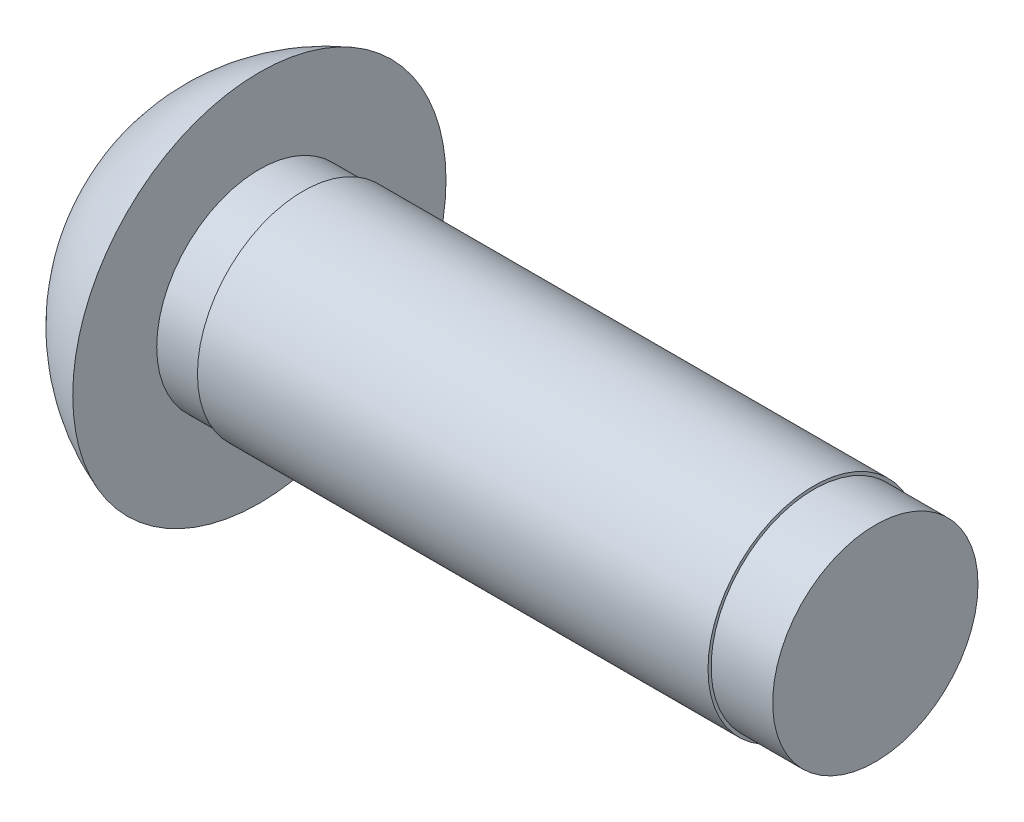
ISO-10303-21;
HEADER;
FILE_DESCRIPTION(('STEP AP214'),'2;1');
FILE_NAME('part.step','',(''),(''),'','','');
FILE_SCHEMA(('AUTOMOTIVE_DESIGN { 1 0 10303 214 1 1 1 1 }'));
ENDSEC;
DATA;
#1=APPLICATION_CONTEXT('core data for automotive mechanical design processes');
#2=APPLICATION_PROTOCOL_DEFINITION('international standard','automotive_design',2000,#1);
#3=PRODUCT_CONTEXT('',#1,'mechanical');
#4=PRODUCT('Part','Part','',(#3));
#5=PRODUCT_RELATED_PRODUCT_CATEGORY('part','',(#4));
#6=PRODUCT_DEFINITION_FORMATION('','',#4);
#7=PRODUCT_DEFINITION_CONTEXT('part definition',#1,'design');
#8=PRODUCT_DEFINITION('design','',#6,#7);
#9=PRODUCT_DEFINITION_SHAPE('','',#8);
#10=(LENGTH_UNIT() NAMED_UNIT(*) SI_UNIT(.MILLI.,.METRE.));
#11=(NAMED_UNIT(*) PLANE_ANGLE_UNIT() SI_UNIT($,.RADIAN.));
#12=(NAMED_UNIT(*) SI_UNIT($,.STERADIAN.) SOLID_ANGLE_UNIT());
#13=UNCERTAINTY_MEASURE_WITH_UNIT(LENGTH_MEASURE(1.E-05),#10,'distance_accuracy_value','');
#14=(GEOMETRIC_REPRESENTATION_CONTEXT(3) GLOBAL_UNCERTAINTY_ASSIGNED_CONTEXT((#13)) GLOBAL_UNIT_ASSIGNED_CONTEXT((#10,
#11,#12)) REPRESENTATION_CONTEXT('',''));
#15=CARTESIAN_POINT('',(0.,0.,0.));
#16=DIRECTION('',(0.,0.,1.));
#17=DIRECTION('',(1.,0.,0.));
#18=AXIS2_PLACEMENT_3D('',#15,#16,#17);
#19=CARTESIAN_POINT('',(-21.423653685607,0.,0.));
#20=DIRECTION('',(-1.,0.,0.));
#21=DIRECTION('',(0.,0.,1.));
#22=AXIS2_PLACEMENT_3D('',#19,#20,#21);
#23=CYLINDRICAL_SURFACE('',#22,2.5);
#24=CARTESIAN_POINT('',(4.26666666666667,0.,0.));
#25=DIRECTION('',(-1.,0.,0.));
#26=DIRECTION('',(0.,0.,1.));
#27=AXIS2_PLACEMENT_3D('',#24,#25,#26);
#28=CIRCLE('',#27,2.5);
#29=CARTESIAN_POINT('',(4.26666666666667,0.,2.5));
#30=VERTEX_POINT('',#29);
#31=EDGE_CURVE('E52',#30,#30,#28,.T.);
#32=ORIENTED_EDGE('',*,*,#31,.T.);
#33=EDGE_LOOP('',(#32));
#34=FACE_BOUND('',#33,.T.);
#35=CARTESIAN_POINT('',(3.2,0.,0.));
#36=DIRECTION('',(-1.,0.,0.));
#37=DIRECTION('',(0.,0.,1.));
#38=AXIS2_PLACEMENT_3D('',#35,#36,#37);
#39=CIRCLE('',#38,2.5);
#40=CARTESIAN_POINT('',(3.2,0.,2.5));
#41=VERTEX_POINT('',#40);
#42=EDGE_CURVE('E12',#41,#41,#39,.T.);
#43=ORIENTED_EDGE('',*,*,#42,.F.);
#44=EDGE_LOOP('',(#43));
#45=FACE_BOUND('',#44,.T.);
#46=ADVANCED_FACE('F37',(#34,#45),#23,.T.);
#47=CARTESIAN_POINT('',(3.2,2.5,0.));
#48=DIRECTION('',(-1.,0.,0.));
#49=DIRECTION('',(0.,0.,1.));
#50=AXIS2_PLACEMENT_3D('',#47,#48,#49);
#51=PLANE('',#50);
#52=CARTESIAN_POINT('',(3.2,0.,0.));
#53=DIRECTION('',(-1.,0.,0.));
#54=DIRECTION('',(0.,0.,1.));
#55=AXIS2_PLACEMENT_3D('',#52,#53,#54);
#56=CIRCLE('',#55,4.545);
#57=CARTESIAN_POINT('',(3.2,0.,4.545));
#58=VERTEX_POINT('',#57);
#59=EDGE_CURVE('E48',#58,#58,#56,.T.);
#60=ORIENTED_EDGE('',*,*,#59,.F.);
#61=EDGE_LOOP('',(#60));
#62=FACE_BOUND('',#61,.T.);
#63=ORIENTED_EDGE('',*,*,#42,.T.);
#64=EDGE_LOOP('',(#63));
#65=FACE_BOUND('',#64,.T.);
#66=ADVANCED_FACE('F94',(#62,#65),#51,.F.);
#67=CARTESIAN_POINT('',(4.82766015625,0.,0.));
#68=DIRECTION('',(-1.,0.,0.));
#69=DIRECTION('',(0.,1.,0.));
#70=AXIS2_PLACEMENT_3D('',#67,#68,#69);
#71=SPHERICAL_SURFACE('',#70,4.82766015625);
#72=ORIENTED_EDGE('',*,*,#59,.T.);
#73=EDGE_LOOP('',(#72));
#74=FACE_BOUND('',#73,.T.);
#75=ADVANCED_FACE('F97',(#74),#71,.T.);
#76=CARTESIAN_POINT('',(4.26666666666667,2.5,0.));
#77=DIRECTION('',(-1.,0.,0.));
#78=DIRECTION('',(0.,0.,1.));
#79=AXIS2_PLACEMENT_3D('',#76,#77,#78);
#80=PLANE('',#79);
#81=CARTESIAN_POINT('',(4.26666666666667,0.,0.));
#82=DIRECTION('',(-1.,0.,0.));
#83=DIRECTION('',(0.,0.,1.));
#84=AXIS2_PLACEMENT_3D('',#81,#82,#83);
#85=CIRCLE('',#84,2.575);
#86=CARTESIAN_POINT('',(4.26666666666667,0.,-2.575));
#87=VERTEX_POINT('',#86);
#88=EDGE_CURVE('E60',#87,#87,#85,.F.);
#89=ORIENTED_EDGE('',*,*,#88,.F.);
#90=EDGE_LOOP('',(#89));
#91=FACE_BOUND('',#90,.T.);
#92=ORIENTED_EDGE('',*,*,#31,.F.);
#93=EDGE_LOOP('',(#92));
#94=FACE_BOUND('',#93,.T.);
#95=ADVANCED_FACE('F90',(#91,#94),#80,.T.);
#96=CARTESIAN_POINT('',(-4.08319984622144,0.,0.));
#97=DIRECTION('',(1.,0.,0.));
#98=DIRECTION('',(0.,0.,-1.));
#99=AXIS2_PLACEMENT_3D('',#96,#97,#98);
#100=CYLINDRICAL_SURFACE('',#99,2.575);
#101=CARTESIAN_POINT('',(16.6999999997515,0.,0.));
#102=DIRECTION('',(-1.,0.,0.));
#103=DIRECTION('',(0.,0.,1.));
#104=AXIS2_PLACEMENT_3D('',#101,#102,#103);
#105=CIRCLE('',#104,2.575);
#106=CARTESIAN_POINT('',(16.6999999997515,0.,-2.575));
#107=VERTEX_POINT('',#106);
#108=EDGE_CURVE('E42',#107,#107,#105,.F.);
#109=CARTESIAN_POINT('',(16.6999999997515,0.,-2.575));
#110=CARTESIAN_POINT('',(16.5704861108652,0.,-2.575));
#111=CARTESIAN_POINT('',(16.4409722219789,0.,-2.575));
#112=CARTESIAN_POINT('',(16.1819444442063,0.,-2.575));
#113=CARTESIAN_POINT('',(16.05243055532,0.,-2.575));
#114=CARTESIAN_POINT('',(15.7934027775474,0.,-2.575));
#115=CARTESIAN_POINT('',(15.6638888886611,0.,-2.575));
#116=CARTESIAN_POINT('',(15.4048611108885,0.,-2.575));
#117=CARTESIAN_POINT('',(15.2753472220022,0.,-2.575));
#118=CARTESIAN_POINT('',(15.0163194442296,0.,-2.575));
#119=CARTESIAN_POINT('',(14.8868055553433,0.,-2.575));
#120=CARTESIAN_POINT('',(14.6277777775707,0.,-2.575));
#121=CARTESIAN_POINT('',(14.4982638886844,0.,-2.575));
#122=CARTESIAN_POINT('',(14.2392361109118,0.,-2.575));
#123=CARTESIAN_POINT('',(14.1097222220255,0.,-2.575));
#124=CARTESIAN_POINT('',(13.8506944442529,0.,-2.575));
#125=CARTESIAN_POINT('',(13.7211805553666,0.,-2.575));
#126=CARTESIAN_POINT('',(13.462152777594,0.,-2.575));
#127=CARTESIAN_POINT('',(13.3326388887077,0.,-2.575));
#128=CARTESIAN_POINT('',(13.0736111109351,0.,-2.575));
#129=CARTESIAN_POINT('',(12.9440972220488,0.,-2.575));
#130=CARTESIAN_POINT('',(12.6850694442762,0.,-2.575));
#131=CARTESIAN_POINT('',(12.5555555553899,0.,-2.575));
#132=CARTESIAN_POINT('',(12.2965277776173,0.,-2.575));
#133=CARTESIAN_POINT('',(12.167013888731,0.,-2.575));
#134=CARTESIAN_POINT('',(11.9079861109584,0.,-2.575));
#135=CARTESIAN_POINT('',(11.7784722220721,0.,-2.575));
#136=CARTESIAN_POINT('',(11.5194444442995,0.,-2.575));
#137=CARTESIAN_POINT('',(11.3899305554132,0.,-2.575));
#138=CARTESIAN_POINT('',(11.1309027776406,0.,-2.575));
#139=CARTESIAN_POINT('',(11.0013888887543,0.,-2.575));
#140=CARTESIAN_POINT('',(10.7423611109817,0.,-2.575));
#141=CARTESIAN_POINT('',(10.6128472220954,0.,-2.575));
#142=CARTESIAN_POINT('',(10.3538194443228,0.,-2.575));
#143=CARTESIAN_POINT('',(10.2243055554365,0.,-2.575));
#144=CARTESIAN_POINT('',(9.9652777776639,0.,-2.575));
#145=CARTESIAN_POINT('',(9.8357638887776,0.,-2.575));
#146=CARTESIAN_POINT('',(9.576736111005,0.,-2.575));
#147=CARTESIAN_POINT('',(9.4472222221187,0.,-2.575));
#148=CARTESIAN_POINT('',(9.1881944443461,0.,-2.575));
#149=CARTESIAN_POINT('',(9.05868055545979,0.,-2.575));
#150=CARTESIAN_POINT('',(8.79965277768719,0.,-2.575));
#151=CARTESIAN_POINT('',(8.67013888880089,0.,-2.575));
#152=CARTESIAN_POINT('',(8.41111111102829,0.,-2.575));
#153=CARTESIAN_POINT('',(8.28159722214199,0.,-2.575));
#154=CARTESIAN_POINT('',(8.02256944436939,0.,-2.575));
#155=CARTESIAN_POINT('',(7.89305555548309,0.,-2.575));
#156=CARTESIAN_POINT('',(7.63402777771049,0.,-2.575));
#157=CARTESIAN_POINT('',(7.50451388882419,0.,-2.575));
#158=CARTESIAN_POINT('',(7.24548611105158,0.,-2.575));
#159=CARTESIAN_POINT('',(7.11597222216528,0.,-2.575));
#160=CARTESIAN_POINT('',(6.85694444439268,0.,-2.575));
#161=CARTESIAN_POINT('',(6.72743055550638,0.,-2.575));
#162=CARTESIAN_POINT('',(6.46840277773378,0.,-2.575));
#163=CARTESIAN_POINT('',(6.33888888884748,0.,-2.575));
#164=CARTESIAN_POINT('',(6.07986111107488,0.,-2.575));
#165=CARTESIAN_POINT('',(5.95034722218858,0.,-2.575));
#166=CARTESIAN_POINT('',(5.69131944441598,0.,-2.575));
#167=CARTESIAN_POINT('',(5.56180555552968,0.,-2.575));
#168=CARTESIAN_POINT('',(5.30277777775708,0.,-2.575));
#169=CARTESIAN_POINT('',(5.17326388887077,0.,-2.575));
#170=CARTESIAN_POINT('',(4.91423611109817,0.,-2.575));
#171=CARTESIAN_POINT('',(4.78472222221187,0.,-2.575));
#172=CARTESIAN_POINT('',(4.52569444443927,0.,-2.575));
#173=CARTESIAN_POINT('',(4.39618055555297,0.,-2.575));
#174=CARTESIAN_POINT('',(4.26666666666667,0.,-2.575));
#175=B_SPLINE_CURVE_WITH_KNOTS('',3,(#109,#110,#111,#112,#113,#114,#115,#116,#117,#118,#119,
#120,#121,#122,#123,#124,#125,#126,#127,#128,#129,#130,#131,#132,#133,#134,#135,#136,#137,#138,
#139,#140,#141,#142,#143,#144,#145,#146,#147,#148,#149,#150,#151,#152,#153,#154,#155,#156,#157,
#158,#159,#160,#161,#162,#163,#164,#165,#166,#167,#168,#169,#170,#171,#172,#173,#174),
.UNSPECIFIED.,.F.,.F.,(4,2,2,2,2,2,2,2,2,2,2,2,2,2,2,2,2,2,2,2,2,2,2,2,2,2,2,2,2,2,2,2,4),(0.,
0.388541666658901,0.777083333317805,1.16562499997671,1.55416666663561,1.94270833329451,
2.33124999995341,2.71979166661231,3.10833333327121,3.49687499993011,3.88541666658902,
4.27395833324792,4.66249999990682,5.05104166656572,5.43958333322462,5.82812499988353,
6.21666666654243,6.60520833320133,6.99374999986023,7.38229166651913,7.77083333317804,
8.15937499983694,8.54791666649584,8.93645833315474,9.32499999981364,9.71354166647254,
10.1020833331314,10.4906249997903,10.8791666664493,11.2677083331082,11.6562499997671,
12.044791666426,12.4333333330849),.UNSPECIFIED.);
#176=EDGE_CURVE('BSEAM83',#107,#87,#175,.T.);
#177=ORIENTED_EDGE('',*,*,#108,.F.);
#178=ORIENTED_EDGE('',*,*,#88,.T.);
#179=ORIENTED_EDGE('',*,*,#176,.T.);
#180=ORIENTED_EDGE('',*,*,#176,.F.);
#181=EDGE_LOOP('',(#177,#179,#178,#180));
#182=FACE_BOUND('',#181,.T.);
#183=ADVANCED_FACE('F83',(#182),#100,.T.);
#184=CARTESIAN_POINT('',(16.6999999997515,2.5,0.));
#185=DIRECTION('',(-1.,0.,0.));
#186=DIRECTION('',(0.,0.,1.));
#187=AXIS2_PLACEMENT_3D('',#184,#185,#186);
#188=PLANE('',#187);
#189=ORIENTED_EDGE('',*,*,#108,.T.);
#190=EDGE_LOOP('',(#189));
#191=FACE_BOUND('',#190,.T.);
#192=CARTESIAN_POINT('',(16.6999999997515,0.,0.));
#193=DIRECTION('',(1.,0.,0.));
#194=DIRECTION('',(0.,0.,-1.));
#195=AXIS2_PLACEMENT_3D('',#192,#193,#194);
#196=CIRCLE('',#195,2.5);
#197=CARTESIAN_POINT('',(16.6999999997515,0.,-2.5));
#198=VERTEX_POINT('',#197);
#199=EDGE_CURVE('E65',#198,#198,#196,.T.);
#200=ORIENTED_EDGE('',*,*,#199,.F.);
#201=EDGE_LOOP('',(#200));
#202=FACE_BOUND('',#201,.T.);
#203=ADVANCED_FACE('F77',(#191,#202),#188,.F.);
#204=CARTESIAN_POINT('',(0.813407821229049,0.,0.));
#205=DIRECTION('',(1.,0.,0.));
#206=DIRECTION('',(0.,0.,-1.));
#207=AXIS2_PLACEMENT_3D('',#204,#205,#206);
#208=CYLINDRICAL_SURFACE('',#207,2.5);
#209=CARTESIAN_POINT('',(18.1999999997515,0.,0.));
#210=DIRECTION('',(1.,0.,0.));
#211=DIRECTION('',(0.,0.,-1.));
#212=AXIS2_PLACEMENT_3D('',#209,#210,#211);
#213=CIRCLE('',#212,2.5);
#214=CARTESIAN_POINT('',(18.1999999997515,0.,-2.5));
#215=VERTEX_POINT('',#214);
#216=EDGE_CURVE('E66',#215,#215,#213,.T.);
#217=ORIENTED_EDGE('',*,*,#216,.F.);
#218=EDGE_LOOP('',(#217));
#219=FACE_BOUND('',#218,.T.);
#220=ORIENTED_EDGE('',*,*,#199,.T.);
#221=EDGE_LOOP('',(#220));
#222=FACE_BOUND('',#221,.T.);
#223=ADVANCED_FACE('F75',(#219,#222),#208,.T.);
#224=CARTESIAN_POINT('',(18.2,0.,0.));
#225=DIRECTION('',(-1.,0.,0.));
#226=DIRECTION('',(0.,0.,1.));
#227=AXIS2_PLACEMENT_3D('',#224,#225,#226);
#228=PLANE('',#227);
#229=ORIENTED_EDGE('',*,*,#216,.T.);
#230=EDGE_LOOP('',(#229));
#231=FACE_BOUND('',#230,.T.);
#232=ADVANCED_FACE('F45',(#231),#228,.F.);
#233=CLOSED_SHELL('',(#46,#66,#75,#95,#183,#203,#223,#232));
#234=MANIFOLD_SOLID_BREP('B2',#233);
#235=ADVANCED_BREP_SHAPE_REPRESENTATION('',(#18,#234),#14);
#236=SHAPE_DEFINITION_REPRESENTATION(#9,#235);
ENDSEC;
END-ISO-10303-21;
